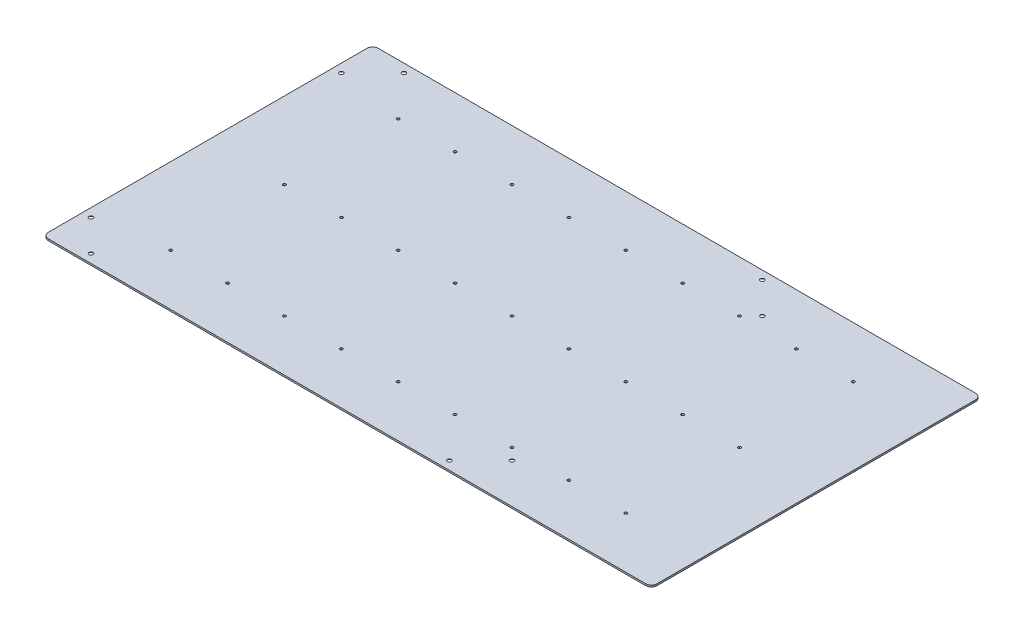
from build123d import *

# Parameters (mm, degrees)
SKETCH_1_W                  = 1070
SKETCH_1_H                  = 580
EXTRUDE_1_DEPTH             = 3
HOLE_WIZARD_M6_1_AT_2_COUNT = 2
HOLE_WIZARD_M6_1_AT_2_PITCH = 77.781745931
HOLE_WIZARD_M6_1_AT_3_COUNT = 2
HOLE_WIZARD_M6_1_AT_3_PITCH = 498.046182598
HOLE_WIZARD_M6_1_AT_4_COUNT = 2
HOLE_WIZARD_M6_1_AT_4_PITCH = 550
HOLE_WIZARD_M6_1_AT_5_COUNT = 2
HOLE_WIZARD_M6_1_AT_5_PITCH = 836.301381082
HOLE_WIZARD_M6_1_AT_6_COUNT = 2
HOLE_WIZARD_M6_1_AT_6_PITCH = 845.133125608
HOLE_WIZARD_M6_1_AT_7_COUNT = 2
HOLE_WIZARD_M6_1_AT_7_PITCH = 687.204481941
HOLE_WIZARD_M6_1_AT_8_COUNT = 2
HOLE_WIZARD_M6_1_AT_8_PITCH = 630
HOLE_WIZARD_M6_1_2_D        = 5
PATTERN_LINEAR_1_COUNT      = 3
PATTERN_LINEAR_1_PITCH      = 200
PATTERN_LINEAR_1_COUNT_DIR2 = 9
PATTERN_LINEAR_1_PITCH_DIR2 = 100
FILLET_1_R                  = 10


with BuildPart() as part:
    # Sketch 1 → Extrude 1 (new body)
    with BuildSketch(Plane(origin=(0, 0, 0), x_dir=(1, 0, 0), z_dir=(0, 1, 0))):
        Rectangle(SKETCH_1_W, SKETCH_1_H)
    extrude(amount=EXTRUDE_1_DEPTH)

    # Sketch 5 → Hole Wizard M6 _1 (revolve, cut)
    with BuildSketch(Plane(origin=(165, 0, -275), x_dir=(0, 0, -1), z_dir=(1, 0, 0))):
        Polygon((0, 0), (0, 3), (3.5, 3), (3.5, 2.9), (6.4, 0), align=None)
    hole_wizard_m6_1 = revolve(axis=Axis((165, -6.35, -275), (0, 1, 0)), mode=Mode.SUBTRACT)

    # Hole Wizard M6 _1 at 2: Hole Wizard M6 _1 ×2
    with Locations(*[Vector(0.7071067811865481, 0, 0.707106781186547) * (i * HOLE_WIZARD_M6_1_AT_2_PITCH) for i in range(1, HOLE_WIZARD_M6_1_AT_2_COUNT)]):
        add(hole_wizard_m6_1, mode=Mode.SUBTRACT)

    # Hole Wizard M6 _1 at 3: Hole Wizard M6 _1 ×2
    with Locations(*[Vector(0.11043152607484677, 0, 0.9938837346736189) * (i * HOLE_WIZARD_M6_1_AT_3_PITCH) for i in range(1, HOLE_WIZARD_M6_1_AT_3_COUNT)]):
        add(hole_wizard_m6_1, mode=Mode.SUBTRACT)

    # Hole Wizard M6 _1 at 4: Hole Wizard M6 _1 ×2
    with Locations(*[(0, 0, i * HOLE_WIZARD_M6_1_AT_4_PITCH) for i in range(1, HOLE_WIZARD_M6_1_AT_4_COUNT)]):
        add(hole_wizard_m6_1, mode=Mode.SUBTRACT)

    # Hole Wizard M6 _1 at 5: Hole Wizard M6 _1 ×2
    with Locations(*[Vector(-0.7533169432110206, 0, 0.6576576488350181) * (i * HOLE_WIZARD_M6_1_AT_5_PITCH) for i in range(1, HOLE_WIZARD_M6_1_AT_5_COUNT)]):
        add(hole_wizard_m6_1, mode=Mode.SUBTRACT)

    # Hole Wizard M6 _1 at 6: Hole Wizard M6 _1 ×2
    with Locations(*[Vector(-0.8105231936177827, 0, 0.5857065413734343) * (i * HOLE_WIZARD_M6_1_AT_6_PITCH) for i in range(1, HOLE_WIZARD_M6_1_AT_6_COUNT)]):
        add(hole_wizard_m6_1, mode=Mode.SUBTRACT)

    # Hole Wizard M6 _1 at 7: Hole Wizard M6 _1 ×2
    with Locations(*[Vector(-0.9967921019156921, 0, 0.08003440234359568) * (i * HOLE_WIZARD_M6_1_AT_7_PITCH) for i in range(1, HOLE_WIZARD_M6_1_AT_7_COUNT)]):
        add(hole_wizard_m6_1, mode=Mode.SUBTRACT)

    # Hole Wizard M6 _1 at 8: Hole Wizard M6 _1 ×2
    with Locations(*[(-i * HOLE_WIZARD_M6_1_AT_8_PITCH, 0, 0) for i in range(1, HOLE_WIZARD_M6_1_AT_8_COUNT)]):
        add(hole_wizard_m6_1, mode=Mode.SUBTRACT)

    # Hole Wizard M6 _1 2 (through all)
    with Locations(Plane(origin=(0, 3, 0), x_dir=(1, 0, 0), z_dir=(0, 1, 0))):
        with Locations((-400, -200)):
            hole_wizard_m6_1_2 = Hole(HOLE_WIZARD_M6_1_2_D / 2)

    # Pattern Linear 1: Hole Wizard M6 _1 2 3 × 9
    with Locations(*[(j * PATTERN_LINEAR_1_PITCH_DIR2, 0, -i * PATTERN_LINEAR_1_PITCH) for i in range(PATTERN_LINEAR_1_COUNT) for j in range(PATTERN_LINEAR_1_COUNT_DIR2) if (i, j) != (0, 0)]):
        add(hole_wizard_m6_1_2, mode=Mode.SUBTRACT)

    # Fillet 1
    fillet_1_edges = [part.edges().sort_by_distance(p)[0] for p in [
        (535, 1.5, 290),
        (-535, 1.5, 290),
        (-535, 1.5, -290),
        (535, 1.5, -290),
    ]]
    fillet(fillet_1_edges, radius=FILLET_1_R)


solid = part.part
